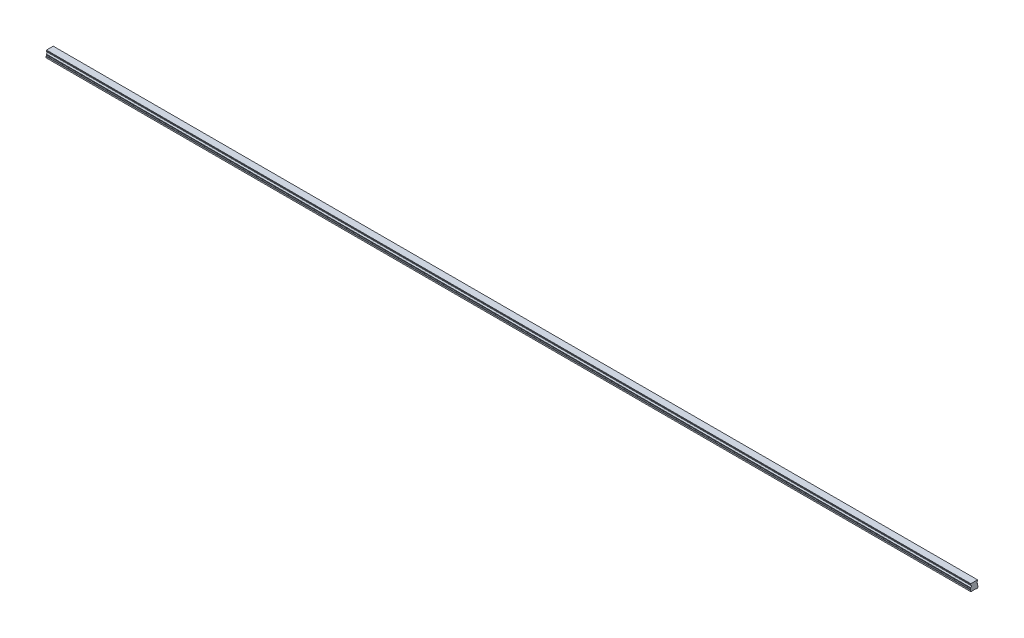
from build123d import *

# Parameters (mm, degrees)
BOSS_EXTRUDE1_DEPTH        = 1800
SKETCH3_R                  = 2.5
SKETCH3_R_2                = 2.1
CUT_EXTRUDE3_DEPTH         = 7
SKETCH3_2_R                = 2.1
CUT_EXTRUDE4_DEPTH         = 9.5
CHAMFER1_SIZE              = 0.4
LPATTERN2_COUNT            = 30
LPATTERN2_PITCH            = 60
CHAMFER1_OF_LPATTERN2_SIZE = 0.4


with BuildPart() as part:
    # Sketch1 → Boss-Extrude1 (new body)
    with BuildSketch(Plane(origin=(0, 0, 0), x_dir=(0, 0, -1), z_dir=(1, 0, 0))):
        with BuildLine():
            Line((6.59, 14), (-6.59, 14))
            Line((-6.59, 14), (-6.59, 13.15))
            Line((-6.59, 13.15), (-6.96, 12.356532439))
            Line((-6.96, 12.356532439), (-6.96, 11.435174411))
            ThreePointArc((-6.96, 11.435174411), (-5.25, 9.5), (-6.96, 7.564825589))
            Line((-6.96, 7.564825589), (-6.96, 6.643467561))
            Line((-6.96, 6.643467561), (-6.59, 5.85))
            Line((-6.59, 5.85), (-7.032116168, 4.2))
            Line((-7.032116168, 4.2), (-7.5, 3.929867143))
            Line((-7.5, 3.929867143), (-7.5, 1.4))
            Line((-7.5, 1.4), (-6.1, 0))
            Line((-6.1, 0), (-3.65, 0))
            Line((-3.65, 0), (-3.25, 0.4))
            Line((-3.25, 0.4), (3.25, 0.4))
            Line((3.25, 0.4), (3.65, 0))
            Line((3.65, 0), (6.1, 0))
            Line((6.1, 0), (7.5, 1.4))
            Line((7.5, 1.4), (7.5, 3.929867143))
            Line((7.5, 3.929867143), (7.032116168, 4.2))
            Line((7.032116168, 4.2), (6.59, 5.85))
            Line((6.59, 5.85), (6.96, 6.643467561))
            Line((6.96, 6.643467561), (6.96, 7.564825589))
            ThreePointArc((6.96, 7.564825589), (5.25, 9.5), (6.96, 11.435174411))
            Line((6.96, 11.435174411), (6.96, 12.356532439))
            Line((6.96, 12.356532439), (6.59, 13.15))
            Line((6.59, 13.15), (6.59, 14))
        make_face()
    extrude(amount=BOSS_EXTRUDE1_DEPTH)

    # Sketch3 → Cut-Extrude3 (cut)
    with BuildSketch(Plane.XZ):
        with Locations(Location((30, 0, 0), (0, 0, 270))):
            Circle(SKETCH3_R)
        with Locations(Location((30, 0, 0), (0, 0, 270))):
            Circle(SKETCH3_R_2, mode=Mode.SUBTRACT)
    cut_extrude3 = extrude(amount=-CUT_EXTRUDE3_DEPTH, mode=Mode.SUBTRACT)

    # Sketch3_2 → Cut-Extrude4 (cut)
    with BuildSketch(Plane.XZ):
        with Locations(Location((30, 0, 0), (0, 0, 270))):
            Circle(SKETCH3_2_R)
    cut_extrude4 = extrude(amount=-CUT_EXTRUDE4_DEPTH, mode=Mode.SUBTRACT)

    # Cut-Extrude5 cone 1 section (on through the dimple's axis) → Cut-Extrude5 (revolve, cut)
    with BuildSketch(Plane(origin=(30, 9.5, 0), x_dir=(0, 0, -1), z_dir=(1, 0, 0))):
        Polygon((0, 0), (2.1, 0), (0, 1.212435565), align=None)
    revolve(axis=Axis((30, 9.5, 0), (0, 1, 0)), mode=Mode.SUBTRACT)

    # Chamfer1
    chamfer1_edges = [part.edges().sort_by_distance(p)[0] for p in [
        (30, 0.4, 2.5),
    ]]
    chamfer(chamfer1_edges, length=CHAMFER1_SIZE)

    # LPattern2: Cut-Extrude3, Cut-Extrude4 ×30
    with Locations(*[(i * LPATTERN2_PITCH, 0, 0) for i in range(1, LPATTERN2_COUNT)]):
        add(cut_extrude3, mode=Mode.SUBTRACT)
        add(cut_extrude4, mode=Mode.SUBTRACT)

    # Chamfer1 of LPattern2
    chamfer1_of_lpattern2_edges = [part.edges().sort_by_distance(p)[0] for p in [
        (90, 0.4, 2.5),
        (150, 0.4, 2.5),
        (210, 0.4, 2.5),
        (270, 0.4, 2.5),
        (330, 0.4, 2.5),
        (390, 0.4, 2.5),
        (450, 0.4, 2.5),
        (510, 0.4, 2.5),
        (570, 0.4, 2.5),
        (630, 0.4, 2.5),
        (690, 0.4, 2.5),
        (750, 0.4, 2.5),
        (810, 0.4, 2.5),
        (870, 0.4, 2.5),
        (930, 0.4, 2.5),
        (990, 0.4, 2.5),
        (1050, 0.4, 2.5),
        (1110, 0.4, 2.5),
        (1170, 0.4, 2.5),
        (1230, 0.4, 2.5),
        (1290, 0.4, 2.5),
        (1350, 0.4, 2.5),
        (1410, 0.4, 2.5),
        (1470, 0.4, 2.5),
        (1530, 0.4, 2.5),
        (1590, 0.4, 2.5),
        (1650, 0.4, 2.5),
        (1710, 0.4, 2.5),
        (1770, 0.4, 2.5),
    ]]
    chamfer(chamfer1_of_lpattern2_edges, length=CHAMFER1_OF_LPATTERN2_SIZE)


solid = part.part
